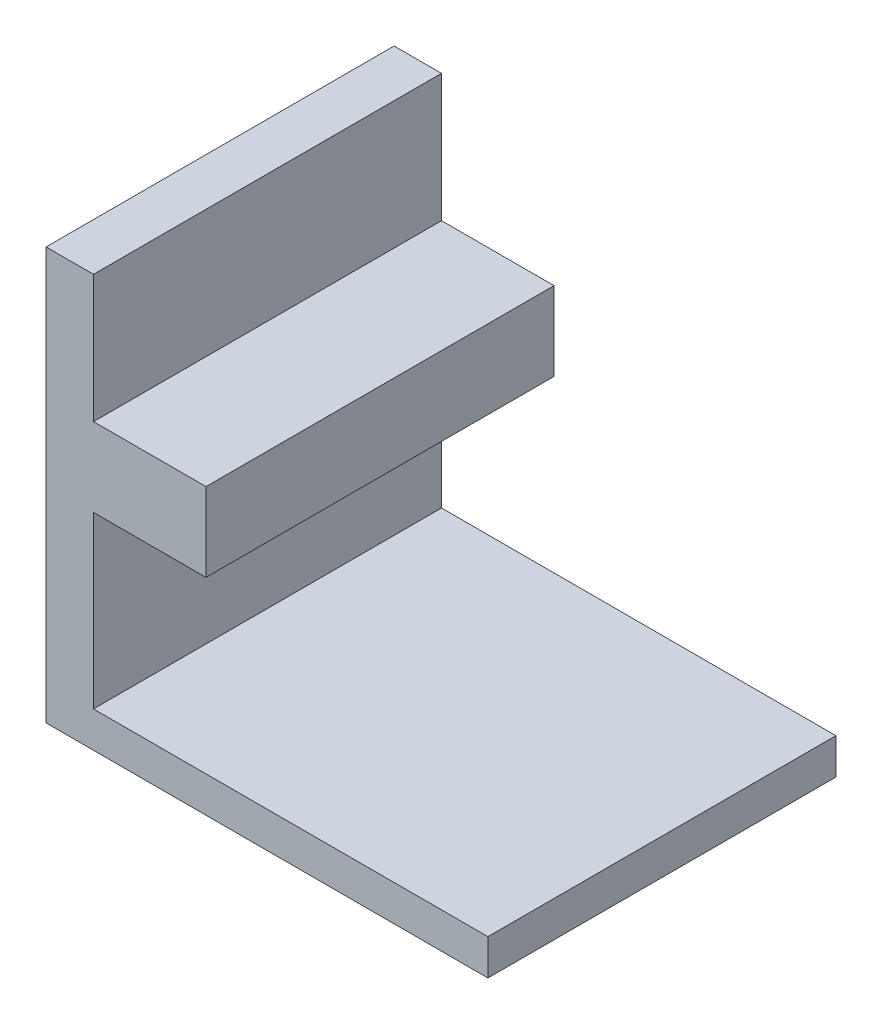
from build123d import *

# Parameters (mm, degrees)
BOSS_EXTRUDE1_DEPTH = 66.5
SKETCH3_W           = 133
SKETCH3_H           = 30.043079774
BOSS_EXTRUDE2_DEPTH = 43


with BuildPart() as part:
    # Sketch1 → Boss-Extrude1 (new, symmetric)
    with BuildSketch(Plane.XY):
        Polygon((0, 157.514311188), (0, 0), (168.839701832, 0), (168.839701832, 13.684496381), (18.117502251, 13.684496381), (18.117502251, 157.514311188), align=None)
    extrude(amount=BOSS_EXTRUDE1_DEPTH, both=True)

    # Sketch3 → Boss-Extrude2 (add)
    with BuildSketch(Plane(origin=(18.117502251, 0, 0), x_dir=(0, 0, -1), z_dir=(1, 0, 0))):
        with Locations((0, 93.740407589)):
            Rectangle(SKETCH3_W, SKETCH3_H)
    extrude(amount=BOSS_EXTRUDE2_DEPTH)


solid = part.part
